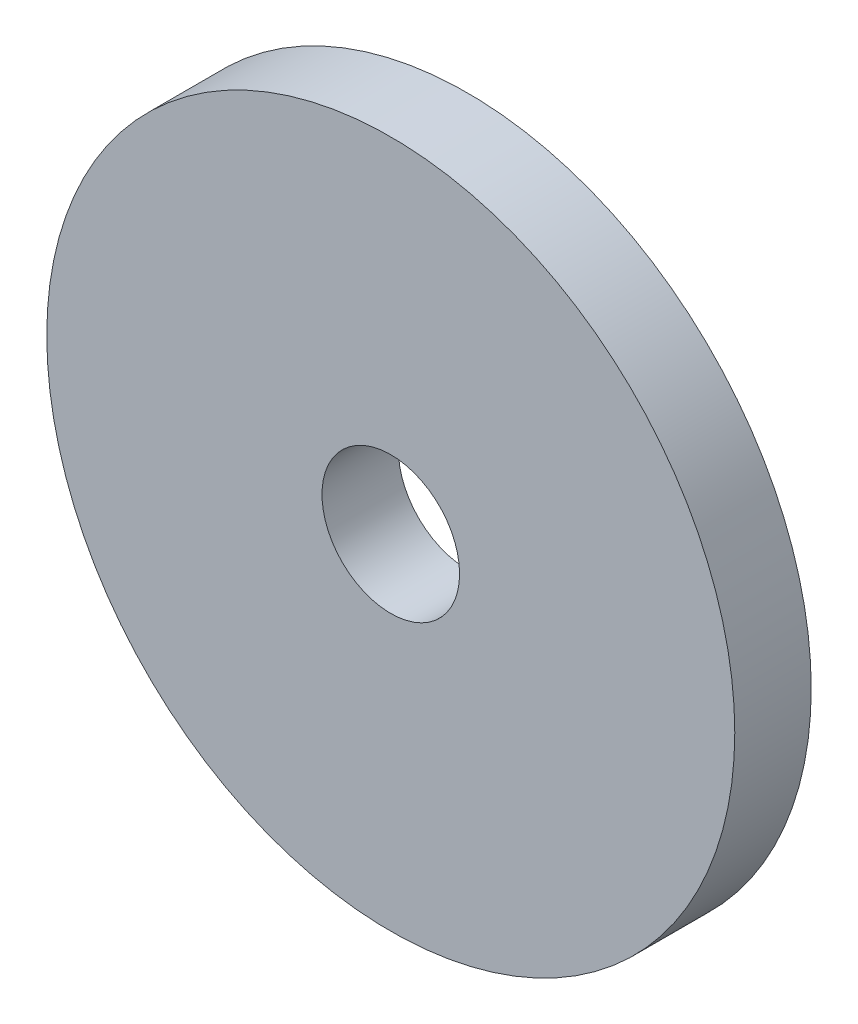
ISO-10303-21;
HEADER;
FILE_DESCRIPTION(('STEP AP214'),'2;1');
FILE_NAME('part.step','',(''),(''),'','','');
FILE_SCHEMA(('AUTOMOTIVE_DESIGN { 1 0 10303 214 1 1 1 1 }'));
ENDSEC;
DATA;
#1=APPLICATION_CONTEXT('core data for automotive mechanical design processes');
#2=APPLICATION_PROTOCOL_DEFINITION('international standard','automotive_design',2000,#1);
#3=PRODUCT_CONTEXT('',#1,'mechanical');
#4=PRODUCT('Part','Part','',(#3));
#5=PRODUCT_RELATED_PRODUCT_CATEGORY('part','',(#4));
#6=PRODUCT_DEFINITION_FORMATION('','',#4);
#7=PRODUCT_DEFINITION_CONTEXT('part definition',#1,'design');
#8=PRODUCT_DEFINITION('design','',#6,#7);
#9=PRODUCT_DEFINITION_SHAPE('','',#8);
#10=(LENGTH_UNIT() NAMED_UNIT(*) SI_UNIT(.MILLI.,.METRE.));
#11=(NAMED_UNIT(*) PLANE_ANGLE_UNIT() SI_UNIT($,.RADIAN.));
#12=(NAMED_UNIT(*) SI_UNIT($,.STERADIAN.) SOLID_ANGLE_UNIT());
#13=UNCERTAINTY_MEASURE_WITH_UNIT(LENGTH_MEASURE(1.E-05),#10,'distance_accuracy_value','');
#14=(GEOMETRIC_REPRESENTATION_CONTEXT(3) GLOBAL_UNCERTAINTY_ASSIGNED_CONTEXT((#13)) GLOBAL_UNIT_ASSIGNED_CONTEXT((#10,
#11,#12)) REPRESENTATION_CONTEXT('',''));
#15=CARTESIAN_POINT('',(0.,0.,0.));
#16=DIRECTION('',(0.,0.,1.));
#17=DIRECTION('',(1.,0.,0.));
#18=AXIS2_PLACEMENT_3D('',#15,#16,#17);
#19=CARTESIAN_POINT('',(0.,0.,9.99999999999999));
#20=DIRECTION('',(0.,0.,1.));
#21=DIRECTION('',(1.,0.,0.));
#22=AXIS2_PLACEMENT_3D('',#19,#20,#21);
#23=PLANE('',#22);
#24=CARTESIAN_POINT('',(0.,0.,9.99999999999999));
#25=DIRECTION('',(0.,0.,1.));
#26=DIRECTION('',(1.,0.,0.));
#27=AXIS2_PLACEMENT_3D('',#24,#25,#26);
#28=CIRCLE('',#27,45.);
#29=CARTESIAN_POINT('',(45.,0.,9.99999999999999));
#30=VERTEX_POINT('',#29);
#31=EDGE_CURVE('E10',#30,#30,#28,.T.);
#32=ORIENTED_EDGE('',*,*,#31,.T.);
#33=EDGE_LOOP('',(#32));
#34=FACE_BOUND('',#33,.T.);
#35=CARTESIAN_POINT('',(0.,0.,9.99999999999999));
#36=DIRECTION('',(0.,0.,1.));
#37=DIRECTION('',(1.,0.,0.));
#38=AXIS2_PLACEMENT_3D('',#35,#36,#37);
#39=CIRCLE('',#38,9.);
#40=CARTESIAN_POINT('',(9.,0.,9.99999999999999));
#41=VERTEX_POINT('',#40);
#42=EDGE_CURVE('E39',#41,#41,#39,.T.);
#43=ORIENTED_EDGE('',*,*,#42,.F.);
#44=EDGE_LOOP('',(#43));
#45=FACE_BOUND('',#44,.T.);
#46=ADVANCED_FACE('F28',(#34,#45),#23,.T.);
#47=CARTESIAN_POINT('',(0.,0.,0.));
#48=DIRECTION('',(0.,0.,1.));
#49=DIRECTION('',(1.,0.,0.));
#50=AXIS2_PLACEMENT_3D('',#47,#48,#49);
#51=PLANE('',#50);
#52=CARTESIAN_POINT('',(0.,0.,0.));
#53=DIRECTION('',(0.,0.,1.));
#54=DIRECTION('',(1.,0.,0.));
#55=AXIS2_PLACEMENT_3D('',#52,#53,#54);
#56=CIRCLE('',#55,45.);
#57=CARTESIAN_POINT('',(45.,0.,0.));
#58=VERTEX_POINT('',#57);
#59=EDGE_CURVE('E35',#58,#58,#56,.T.);
#60=ORIENTED_EDGE('',*,*,#59,.F.);
#61=EDGE_LOOP('',(#60));
#62=FACE_BOUND('',#61,.T.);
#63=CARTESIAN_POINT('',(0.,0.,0.));
#64=DIRECTION('',(0.,0.,1.));
#65=DIRECTION('',(1.,0.,0.));
#66=AXIS2_PLACEMENT_3D('',#63,#64,#65);
#67=CIRCLE('',#66,9.);
#68=CARTESIAN_POINT('',(9.,0.,0.));
#69=VERTEX_POINT('',#68);
#70=EDGE_CURVE('E43',#69,#69,#67,.T.);
#71=ORIENTED_EDGE('',*,*,#70,.T.);
#72=EDGE_LOOP('',(#71));
#73=FACE_BOUND('',#72,.T.);
#74=ADVANCED_FACE('F49',(#62,#73),#51,.F.);
#75=CARTESIAN_POINT('',(0.,0.,9.99999999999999));
#76=DIRECTION('',(0.,0.,-1.));
#77=DIRECTION('',(-1.,0.,0.));
#78=AXIS2_PLACEMENT_3D('',#75,#76,#77);
#79=CYLINDRICAL_SURFACE('',#78,45.);
#80=ORIENTED_EDGE('',*,*,#31,.F.);
#81=EDGE_LOOP('',(#80));
#82=FACE_BOUND('',#81,.T.);
#83=ORIENTED_EDGE('',*,*,#59,.T.);
#84=EDGE_LOOP('',(#83));
#85=FACE_BOUND('',#84,.T.);
#86=ADVANCED_FACE('F30',(#82,#85),#79,.T.);
#87=CARTESIAN_POINT('',(0.,0.,9.99999999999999));
#88=DIRECTION('',(0.,0.,-1.));
#89=DIRECTION('',(-1.,0.,0.));
#90=AXIS2_PLACEMENT_3D('',#87,#88,#89);
#91=CYLINDRICAL_SURFACE('',#90,9.);
#92=ORIENTED_EDGE('',*,*,#42,.T.);
#93=EDGE_LOOP('',(#92));
#94=FACE_BOUND('',#93,.T.);
#95=ORIENTED_EDGE('',*,*,#70,.F.);
#96=EDGE_LOOP('',(#95));
#97=FACE_BOUND('',#96,.T.);
#98=ADVANCED_FACE('F51',(#94,#97),#91,.F.);
#99=CLOSED_SHELL('',(#46,#74,#86,#98));
#100=MANIFOLD_SOLID_BREP('B2',#99);
#101=ADVANCED_BREP_SHAPE_REPRESENTATION('',(#18,#100),#14);
#102=SHAPE_DEFINITION_REPRESENTATION(#9,#101);
ENDSEC;
END-ISO-10303-21;
